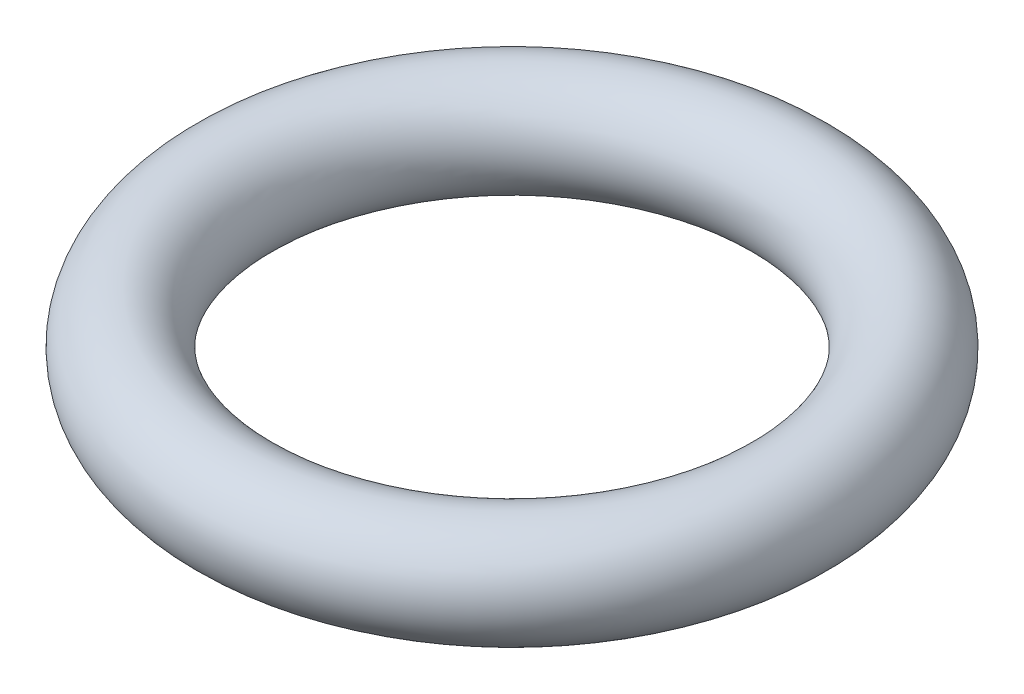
ISO-10303-21;
HEADER;
FILE_DESCRIPTION(('STEP AP214'),'2;1');
FILE_NAME('part.step','',(''),(''),'','','');
FILE_SCHEMA(('AUTOMOTIVE_DESIGN { 1 0 10303 214 1 1 1 1 }'));
ENDSEC;
DATA;
#1=APPLICATION_CONTEXT('core data for automotive mechanical design processes');
#2=APPLICATION_PROTOCOL_DEFINITION('international standard','automotive_design',2000,#1);
#3=PRODUCT_CONTEXT('',#1,'mechanical');
#4=PRODUCT('Part','Part','',(#3));
#5=PRODUCT_RELATED_PRODUCT_CATEGORY('part','',(#4));
#6=PRODUCT_DEFINITION_FORMATION('','',#4);
#7=PRODUCT_DEFINITION_CONTEXT('part definition',#1,'design');
#8=PRODUCT_DEFINITION('design','',#6,#7);
#9=PRODUCT_DEFINITION_SHAPE('','',#8);
#10=(LENGTH_UNIT() NAMED_UNIT(*) SI_UNIT(.MILLI.,.METRE.));
#11=(NAMED_UNIT(*) PLANE_ANGLE_UNIT() SI_UNIT($,.RADIAN.));
#12=(NAMED_UNIT(*) SI_UNIT($,.STERADIAN.) SOLID_ANGLE_UNIT());
#13=UNCERTAINTY_MEASURE_WITH_UNIT(LENGTH_MEASURE(1.E-05),#10,'distance_accuracy_value','');
#14=(GEOMETRIC_REPRESENTATION_CONTEXT(3) GLOBAL_UNCERTAINTY_ASSIGNED_CONTEXT((#13)) GLOBAL_UNIT_ASSIGNED_CONTEXT((#10,
#11,#12)) REPRESENTATION_CONTEXT('',''));
#15=CARTESIAN_POINT('',(0.,0.,0.));
#16=DIRECTION('',(0.,0.,1.));
#17=DIRECTION('',(1.,0.,0.));
#18=AXIS2_PLACEMENT_3D('',#15,#16,#17);
#19=CARTESIAN_POINT('',(0.,0.,0.));
#20=DIRECTION('',(0.,1.,0.));
#21=DIRECTION('',(0.,0.,1.));
#22=AXIS2_PLACEMENT_3D('',#19,#20,#21);
#23=TOROIDAL_SURFACE('',#22,6.270625,1.190625);
#24=CARTESIAN_POINT('',(0.,0.,7.46125));
#25=VERTEX_POINT('',#24);
#26=VERTEX_LOOP('',#25);
#27=FACE_BOUND('',#26,.T.);
#28=ADVANCED_FACE('F30',(#27),#23,.T.);
#29=CLOSED_SHELL('',(#28));
#30=MANIFOLD_SOLID_BREP('B2',#29);
#31=ADVANCED_BREP_SHAPE_REPRESENTATION('',(#18,#30),#14);
#32=SHAPE_DEFINITION_REPRESENTATION(#9,#31);
ENDSEC;
END-ISO-10303-21;
